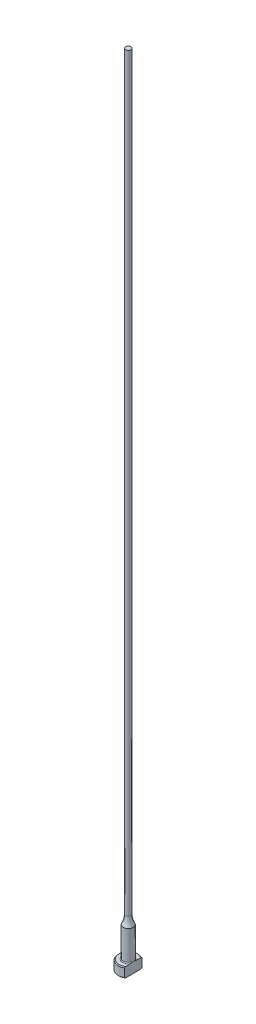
ISO-10303-21;
HEADER;
FILE_DESCRIPTION(('STEP AP214'),'2;1');
FILE_NAME('part.step','',(''),(''),'','','');
FILE_SCHEMA(('AUTOMOTIVE_DESIGN { 1 0 10303 214 1 1 1 1 }'));
ENDSEC;
DATA;
#1=APPLICATION_CONTEXT('core data for automotive mechanical design processes');
#2=APPLICATION_PROTOCOL_DEFINITION('international standard','automotive_design',2000,#1);
#3=PRODUCT_CONTEXT('',#1,'mechanical');
#4=PRODUCT('Part','Part','',(#3));
#5=PRODUCT_RELATED_PRODUCT_CATEGORY('part','',(#4));
#6=PRODUCT_DEFINITION_FORMATION('','',#4);
#7=PRODUCT_DEFINITION_CONTEXT('part definition',#1,'design');
#8=PRODUCT_DEFINITION('design','',#6,#7);
#9=PRODUCT_DEFINITION_SHAPE('','',#8);
#10=(LENGTH_UNIT() NAMED_UNIT(*) SI_UNIT(.MILLI.,.METRE.));
#11=(NAMED_UNIT(*) PLANE_ANGLE_UNIT() SI_UNIT($,.RADIAN.));
#12=(NAMED_UNIT(*) SI_UNIT($,.STERADIAN.) SOLID_ANGLE_UNIT());
#13=UNCERTAINTY_MEASURE_WITH_UNIT(LENGTH_MEASURE(1.E-05),#10,'distance_accuracy_value','');
#14=(GEOMETRIC_REPRESENTATION_CONTEXT(3) GLOBAL_UNCERTAINTY_ASSIGNED_CONTEXT((#13)) GLOBAL_UNIT_ASSIGNED_CONTEXT((#10,
#11,#12)) REPRESENTATION_CONTEXT('',''));
#15=CARTESIAN_POINT('',(0.,0.,0.));
#16=DIRECTION('',(0.,0.,1.));
#17=DIRECTION('',(1.,0.,0.));
#18=AXIS2_PLACEMENT_3D('',#15,#16,#17);
#19=CARTESIAN_POINT('',(-3.17499999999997,3.175,0.));
#20=DIRECTION('',(0.,1.,0.));
#21=DIRECTION('',(0.,0.,1.));
#22=AXIS2_PLACEMENT_3D('',#19,#20,#21);
#23=PLANE('',#22);
#24=CARTESIAN_POINT('',(0.,3.175,0.));
#25=DIRECTION('',(0.,1.,0.));
#26=DIRECTION('',(0.,0.,1.));
#27=AXIS2_PLACEMENT_3D('',#24,#25,#26);
#28=CIRCLE('',#27,2.92099999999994);
#29=CARTESIAN_POINT('',(1.58749999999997,3.175,-2.45195529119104));
#30=VERTEX_POINT('',#29);
#31=CARTESIAN_POINT('',(1.58749999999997,3.175,2.45195529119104));
#32=VERTEX_POINT('',#31);
#33=EDGE_CURVE('E105',#30,#32,#28,.T.);
#34=ORIENTED_EDGE('',*,*,#33,.T.);
#35=DIRECTION('',(0.,0.,1.));
#36=VECTOR('',#35,1.);
#37=CARTESIAN_POINT('',(1.58749999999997,3.17499999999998,2.74963065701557));
#38=LINE('',#37,#36);
#39=CARTESIAN_POINT('',(1.58749999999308,3.175,0.933255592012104));
#40=VERTEX_POINT('',#39);
#41=EDGE_CURVE('E126',#40,#32,#38,.T.);
#42=ORIENTED_EDGE('',*,*,#41,.F.);
#43=CARTESIAN_POINT('',(0.,3.175,0.));
#44=DIRECTION('',(0.,1.,0.));
#45=DIRECTION('',(0.,0.,1.));
#46=AXIS2_PLACEMENT_3D('',#43,#44,#45);
#47=CIRCLE('',#46,1.84149999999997);
#48=CARTESIAN_POINT('',(1.58749999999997,3.17500000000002,-0.933255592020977));
#49=VERTEX_POINT('',#48);
#50=EDGE_CURVE('E11',#40,#49,#47,.F.);
#51=ORIENTED_EDGE('',*,*,#50,.T.);
#52=EDGE_CURVE('E52',#30,#49,#38,.T.);
#53=ORIENTED_EDGE('',*,*,#52,.F.);
#54=EDGE_LOOP('',(#34,#42,#51,#53));
#55=FACE_BOUND('',#54,.T.);
#56=ADVANCED_FACE('F32',(#55),#23,.T.);
#57=CARTESIAN_POINT('',(0.,259.958771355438,0.));
#58=DIRECTION('',(0.,1.,0.));
#59=DIRECTION('',(0.,0.,1.));
#60=AXIS2_PLACEMENT_3D('',#57,#58,#59);
#61=CYLINDRICAL_SURFACE('',#60,3.17499999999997);
#62=CARTESIAN_POINT('',(0.,2.92100000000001,0.));
#63=DIRECTION('',(0.,1.,0.));
#64=DIRECTION('',(0.,0.,1.));
#65=AXIS2_PLACEMENT_3D('',#62,#63,#64);
#66=CIRCLE('',#65,3.17499999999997);
#67=CARTESIAN_POINT('',(1.58749999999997,2.92100000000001,2.74963065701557));
#68=VERTEX_POINT('',#67);
#69=CARTESIAN_POINT('',(1.58749999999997,2.92100000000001,-2.74963065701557));
#70=VERTEX_POINT('',#69);
#71=EDGE_CURVE('E98',#68,#70,#66,.F.);
#72=ORIENTED_EDGE('',*,*,#71,.T.);
#73=DIRECTION('',(0.,-1.,0.));
#74=VECTOR('',#73,1.);
#75=CARTESIAN_POINT('',(1.58749999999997,254.001,-2.74963065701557));
#76=LINE('',#75,#74);
#77=CARTESIAN_POINT('',(1.58749999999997,0.253999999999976,-2.74963065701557));
#78=VERTEX_POINT('',#77);
#79=EDGE_CURVE('E141',#70,#78,#76,.T.);
#80=ORIENTED_EDGE('',*,*,#79,.T.);
#81=CARTESIAN_POINT('',(0.,0.253999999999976,0.));
#82=DIRECTION('',(0.,-1.,0.));
#83=DIRECTION('',(0.,0.,-1.));
#84=AXIS2_PLACEMENT_3D('',#81,#82,#83);
#85=CIRCLE('',#84,3.17499999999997);
#86=CARTESIAN_POINT('',(1.58749999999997,0.253999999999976,2.74963065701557));
#87=VERTEX_POINT('',#86);
#88=EDGE_CURVE('E95',#78,#87,#85,.F.);
#89=ORIENTED_EDGE('',*,*,#88,.T.);
#90=DIRECTION('',(0.,-1.,0.));
#91=VECTOR('',#90,1.);
#92=CARTESIAN_POINT('',(1.58749999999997,254.001,2.74963065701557));
#93=LINE('',#92,#91);
#94=EDGE_CURVE('E88',#68,#87,#93,.T.);
#95=ORIENTED_EDGE('',*,*,#94,.F.);
#96=EDGE_LOOP('',(#72,#80,#89,#95));
#97=FACE_BOUND('',#96,.T.);
#98=ADVANCED_FACE('F191',(#97),#61,.T.);
#99=CARTESIAN_POINT('',(0.,0.,0.));
#100=DIRECTION('',(0.,-1.,0.));
#101=DIRECTION('',(0.,0.,-1.));
#102=AXIS2_PLACEMENT_3D('',#99,#100,#101);
#103=PLANE('',#102);
#104=CARTESIAN_POINT('',(0.,0.,0.));
#105=DIRECTION('',(0.,-1.,0.));
#106=DIRECTION('',(0.,0.,-1.));
#107=AXIS2_PLACEMENT_3D('',#104,#105,#106);
#108=CIRCLE('',#107,2.92100000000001);
#109=CARTESIAN_POINT('',(1.58749999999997,0.,2.45195529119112));
#110=VERTEX_POINT('',#109);
#111=CARTESIAN_POINT('',(1.58749999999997,0.,-2.45195529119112));
#112=VERTEX_POINT('',#111);
#113=EDGE_CURVE('E93',#110,#112,#108,.T.);
#114=ORIENTED_EDGE('',*,*,#113,.T.);
#115=DIRECTION('',(0.,0.,1.));
#116=VECTOR('',#115,1.);
#117=CARTESIAN_POINT('',(1.58749999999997,0.,2.74963065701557));
#118=LINE('',#117,#116);
#119=EDGE_CURVE('E78',#112,#110,#118,.T.);
#120=ORIENTED_EDGE('',*,*,#119,.T.);
#121=EDGE_LOOP('',(#114,#120));
#122=FACE_BOUND('',#121,.T.);
#123=ADVANCED_FACE('F97',(#122),#103,.T.);
#124=CARTESIAN_POINT('',(0.,3.17499999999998,0.));
#125=DIRECTION('',(0.,-1.,0.));
#126=DIRECTION('',(0.,0.,-1.));
#127=AXIS2_PLACEMENT_3D('',#124,#125,#126);
#128=CONICAL_SURFACE('',#127,2.92099999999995,0.785398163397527);
#129=ORIENTED_EDGE('',*,*,#71,.F.);
#130=CARTESIAN_POINT('',(1.58749999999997,-0.16162066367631,-6.0529050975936));
#131=CARTESIAN_POINT('',(1.58749999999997,-0.0288893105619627,-5.91567682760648));
#132=CARTESIAN_POINT('',(1.58749999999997,0.103699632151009,-5.7783103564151));
#133=CARTESIAN_POINT('',(1.58749999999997,0.368508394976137,-5.50321874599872));
#134=CARTESIAN_POINT('',(1.58749999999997,0.500728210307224,-5.36549360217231));
#135=CARTESIAN_POINT('',(1.58749999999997,0.764778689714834,-5.08953516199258));
#136=CARTESIAN_POINT('',(1.58749999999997,0.896609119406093,-4.9513016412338));
#137=CARTESIAN_POINT('',(1.58749999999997,1.15968706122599,-4.67428233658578));
#138=CARTESIAN_POINT('',(1.58749999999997,1.29093457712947,-4.53549655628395));
#139=CARTESIAN_POINT('',(1.58749999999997,1.55007705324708,-4.25997724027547));
#140=CARTESIAN_POINT('',(1.58749999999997,1.67798684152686,-4.12325766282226));
#141=CARTESIAN_POINT('',(1.58749999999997,1.9328486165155,-3.84892898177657));
#142=CARTESIAN_POINT('',(1.58749999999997,2.05980060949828,-3.71131988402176));
#143=CARTESIAN_POINT('',(1.58749999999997,2.31237508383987,-3.43493978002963));
#144=CARTESIAN_POINT('',(1.58749999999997,2.43799784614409,-3.29616903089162));
#145=CARTESIAN_POINT('',(1.58749999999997,2.68741369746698,-3.01699558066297));
#146=CARTESIAN_POINT('',(1.58749999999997,2.81120686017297,-2.8765929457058));
#147=CARTESIAN_POINT('',(1.58749999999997,3.00875865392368,-2.64816703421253));
#148=CARTESIAN_POINT('',(1.58749999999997,3.08336151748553,-2.56087478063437));
#149=CARTESIAN_POINT('',(1.58749999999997,3.2312387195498,-2.38515423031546));
#150=CARTESIAN_POINT('',(1.58749999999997,3.30451292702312,-2.29672582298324));
#151=CARTESIAN_POINT('',(1.58749999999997,3.45004422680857,-2.1174740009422));
#152=CARTESIAN_POINT('',(1.58749999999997,3.5222823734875,-2.02663514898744));
#153=CARTESIAN_POINT('',(1.58749999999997,3.66423097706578,-1.8430252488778));
#154=CARTESIAN_POINT('',(1.58749999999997,3.73394203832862,-1.75025467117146));
#155=CARTESIAN_POINT('',(1.58749999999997,3.87080633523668,-1.5606747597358));
#156=CARTESIAN_POINT('',(1.58749999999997,3.93790459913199,-1.46382547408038));
#157=CARTESIAN_POINT('',(1.58749999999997,4.06669147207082,-1.26632594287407));
#158=CARTESIAN_POINT('',(1.58749999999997,4.1283726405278,-1.16567073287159));
#159=CARTESIAN_POINT('',(1.58749999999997,4.21402252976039,-1.01165766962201));
#160=CARTESIAN_POINT('',(1.58749999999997,4.24127929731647,-0.960142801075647));
#161=CARTESIAN_POINT('',(1.58749999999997,4.2930979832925,-0.855780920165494));
#162=CARTESIAN_POINT('',(1.58749999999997,4.31765941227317,-0.802933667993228));
#163=CARTESIAN_POINT('',(1.58749999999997,4.38614656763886,-0.642461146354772));
#164=CARTESIAN_POINT('',(1.58749999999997,4.42510149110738,-0.532518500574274));
#165=CARTESIAN_POINT('',(1.58749999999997,4.46726244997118,-0.367680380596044));
#166=CARTESIAN_POINT('',(1.58749999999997,4.47844427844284,-0.314802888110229));
#167=CARTESIAN_POINT('',(1.58749999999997,4.49576654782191,-0.208209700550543));
#168=CARTESIAN_POINT('',(1.58749999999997,4.50190743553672,-0.154494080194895));
#169=CARTESIAN_POINT('',(1.58749999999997,4.50871296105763,-0.0468792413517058));
#170=CARTESIAN_POINT('',(1.58749999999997,4.5093945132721,0.00701889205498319));
#171=CARTESIAN_POINT('',(1.58749999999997,4.50527679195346,0.114606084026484));
#172=CARTESIAN_POINT('',(1.58749999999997,4.50047706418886,0.168295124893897));
#173=CARTESIAN_POINT('',(1.58749999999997,4.48579689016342,0.27448544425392));
#174=CARTESIAN_POINT('',(1.58749999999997,4.47596081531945,0.32699298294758));
#175=CARTESIAN_POINT('',(1.58749999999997,4.45181809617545,0.430974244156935));
#176=CARTESIAN_POINT('',(1.58749999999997,4.4375096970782,0.482447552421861));
#177=CARTESIAN_POINT('',(1.58749999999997,4.40502489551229,0.584460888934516));
#178=CARTESIAN_POINT('',(1.58749999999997,4.386827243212,0.634994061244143));
#179=CARTESIAN_POINT('',(1.58749999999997,4.34729308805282,0.734789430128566));
#180=CARTESIAN_POINT('',(1.58749999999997,4.3259572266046,0.784051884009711));
#181=CARTESIAN_POINT('',(1.58749999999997,4.25791922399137,0.930549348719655));
#182=CARTESIAN_POINT('',(1.58749999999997,4.20736047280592,1.0259880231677));
#183=CARTESIAN_POINT('',(1.58749999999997,4.0995545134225,1.21304313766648));
#184=CARTESIAN_POINT('',(1.58749999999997,4.04229912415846,1.30465471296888));
#185=CARTESIAN_POINT('',(1.58749999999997,3.92308746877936,1.48526211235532));
#186=CARTESIAN_POINT('',(1.58749999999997,3.86111349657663,1.57424615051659));
#187=CARTESIAN_POINT('',(1.58749999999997,3.73408621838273,1.74990003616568));
#188=CARTESIAN_POINT('',(1.58749999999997,3.66903444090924,1.83657099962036));
#189=CARTESIAN_POINT('',(1.58749999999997,3.53583371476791,2.00931764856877));
#190=CARTESIAN_POINT('',(1.58749999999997,3.46765527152,2.09537048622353));
#191=CARTESIAN_POINT('',(1.58749999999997,3.32960643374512,2.26611736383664));
#192=CARTESIAN_POINT('',(1.58749999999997,3.25973586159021,2.35081125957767));
#193=CARTESIAN_POINT('',(1.58749999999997,3.04858139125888,2.60290121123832));
#194=CARTESIAN_POINT('',(1.58749999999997,2.90542388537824,2.76872537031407));
#195=CARTESIAN_POINT('',(1.58749999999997,2.64069522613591,3.06970913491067));
#196=CARTESIAN_POINT('',(1.58749999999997,2.51959458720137,3.20528660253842));
#197=CARTESIAN_POINT('',(1.58749999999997,2.27590400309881,3.47510321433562));
#198=CARTESIAN_POINT('',(1.58749999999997,2.15331401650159,3.60934232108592));
#199=CARTESIAN_POINT('',(1.58749999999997,1.90694239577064,3.87695374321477));
#200=CARTESIAN_POINT('',(1.58749999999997,1.78315974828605,4.0103251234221));
#201=CARTESIAN_POINT('',(1.58749999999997,1.53478104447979,4.27630880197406));
#202=CARTESIAN_POINT('',(1.58749999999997,1.41018498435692,4.40892109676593));
#203=CARTESIAN_POINT('',(1.58749999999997,1.0457468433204,4.79499418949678));
#204=CARTESIAN_POINT('',(1.58749999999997,0.80507680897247,5.04767313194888));
#205=CARTESIAN_POINT('',(1.58749999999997,0.443121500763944,5.42550911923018));
#206=CARTESIAN_POINT('',(1.58749999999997,0.322378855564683,5.55118772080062));
#207=CARTESIAN_POINT('',(1.58749999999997,0.0805914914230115,5.80225207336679));
#208=CARTESIAN_POINT('',(1.58749999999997,-0.040453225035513,5.92763782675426));
#209=CARTESIAN_POINT('',(1.58749999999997,-0.161620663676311,6.0529050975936));
#210=B_SPLINE_CURVE_WITH_KNOTS('',3,(#130,#131,#132,#133,#134,#135,#136,#137,#138,#139,#140,
#141,#142,#143,#144,#145,#146,#147,#148,#149,#150,#151,#152,#153,#154,#155,#156,#157,#158,#159,
#160,#161,#162,#163,#164,#165,#166,#167,#168,#169,#170,#171,#172,#173,#174,#175,#176,#177,#178,
#179,#180,#181,#182,#183,#184,#185,#186,#187,#188,#189,#190,#191,#192,#193,#194,#195,#196,#197,
#198,#199,#200,#201,#202,#203,#204,#205,#206,#207,#208,#209),.UNSPECIFIED.,.F.,.F.,(4,2,2,2,2,2,
2,2,2,2,2,2,2,2,2,2,2,2,2,2,2,2,2,2,2,2,2,2,2,2,2,2,2,2,2,2,2,2,2,4),(0.,0.572750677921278,
1.14550874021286,1.71856057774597,2.29160869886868,2.85328006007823,3.4149477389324,
3.97649423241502,4.53801804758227,4.88249307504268,5.22700189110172,5.5751532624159,
5.92322081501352,6.27657800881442,6.63041319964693,6.80518126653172,6.9799810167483,
7.3282426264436,7.49018491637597,7.65211285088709,7.81353889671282,7.97497832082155,
8.13501929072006,8.29512313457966,8.45612518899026,8.61709438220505,8.94062993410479,
9.2645649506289,9.58978187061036,9.91483894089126,10.2441741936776,10.5735441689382,
11.2306812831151,11.7760337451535,12.3214014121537,12.8672825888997,13.4131663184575,
14.4600164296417,14.9828595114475,15.5056983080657),.UNSPECIFIED.);
#211=EDGE_CURVE('E118',#32,#68,#210,.T.);
#212=ORIENTED_EDGE('',*,*,#211,.F.);
#213=ORIENTED_EDGE('',*,*,#33,.F.);
#214=EDGE_CURVE('E117',#70,#30,#210,.T.);
#215=ORIENTED_EDGE('',*,*,#214,.F.);
#216=EDGE_LOOP('',(#129,#212,#213,#215));
#217=FACE_BOUND('',#216,.T.);
#218=ADVANCED_FACE('F162',(#217),#128,.T.);
#219=CARTESIAN_POINT('',(0.,0.253999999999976,0.));
#220=DIRECTION('',(0.,1.,0.));
#221=DIRECTION('',(0.,0.,1.));
#222=AXIS2_PLACEMENT_3D('',#219,#220,#221);
#223=CONICAL_SURFACE('',#222,3.17499999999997,0.785398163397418);
#224=ORIENTED_EDGE('',*,*,#88,.F.);
#225=CARTESIAN_POINT('',(1.58749999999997,3.33662066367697,6.0529050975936));
#226=CARTESIAN_POINT('',(1.58749999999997,3.20388931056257,5.91567682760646));
#227=CARTESIAN_POINT('',(1.58749999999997,3.07130036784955,5.77831035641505));
#228=CARTESIAN_POINT('',(1.58749999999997,2.80649160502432,5.50321874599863));
#229=CARTESIAN_POINT('',(1.58749999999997,2.67427178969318,5.3654936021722));
#230=CARTESIAN_POINT('',(1.58749999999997,2.41022131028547,5.08953516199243));
#231=CARTESIAN_POINT('',(1.58749999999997,2.27839088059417,4.95130164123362));
#232=CARTESIAN_POINT('',(1.58749999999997,2.01531293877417,4.67428233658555));
#233=CARTESIAN_POINT('',(1.58749999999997,1.88406542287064,4.5354965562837));
#234=CARTESIAN_POINT('',(1.58749999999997,1.62492294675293,4.25997724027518));
#235=CARTESIAN_POINT('',(1.58749999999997,1.49701315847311,4.12325766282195));
#236=CARTESIAN_POINT('',(1.58749999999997,1.24215138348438,3.84892898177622));
#237=CARTESIAN_POINT('',(1.58749999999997,1.11519939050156,3.71131988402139));
#238=CARTESIAN_POINT('',(1.58749999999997,0.862624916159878,3.43493978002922));
#239=CARTESIAN_POINT('',(1.58749999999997,0.737002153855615,3.29616903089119));
#240=CARTESIAN_POINT('',(1.58749999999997,0.487586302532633,3.01699558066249));
#241=CARTESIAN_POINT('',(1.58749999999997,0.363793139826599,2.8765929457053));
#242=CARTESIAN_POINT('',(1.58749999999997,0.166241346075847,2.64816703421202));
#243=CARTESIAN_POINT('',(1.58749999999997,0.0916384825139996,2.56087478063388));
#244=CARTESIAN_POINT('',(1.58749999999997,-0.0562387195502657,2.385154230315));
#245=CARTESIAN_POINT('',(1.58749999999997,-0.129512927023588,2.29672582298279));
#246=CARTESIAN_POINT('',(1.58749999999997,-0.27504422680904,2.11747400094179));
#247=CARTESIAN_POINT('',(1.58749999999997,-0.347282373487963,2.02663514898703));
#248=CARTESIAN_POINT('',(1.58749999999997,-0.489230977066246,1.84302524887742));
#249=CARTESIAN_POINT('',(1.58749999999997,-0.558942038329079,1.7502546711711));
#250=CARTESIAN_POINT('',(1.58749999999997,-0.695806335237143,1.56067475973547));
#251=CARTESIAN_POINT('',(1.58749999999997,-0.762904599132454,1.46382547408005));
#252=CARTESIAN_POINT('',(1.58749999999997,-0.891691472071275,1.26632594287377));
#253=CARTESIAN_POINT('',(1.58749999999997,-0.953372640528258,1.16567073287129));
#254=CARTESIAN_POINT('',(1.58749999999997,-1.03902252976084,1.01165766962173));
#255=CARTESIAN_POINT('',(1.58749999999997,-1.06627929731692,0.960142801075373));
#256=CARTESIAN_POINT('',(1.58749999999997,-1.11809798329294,0.85578092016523));
#257=CARTESIAN_POINT('',(1.58749999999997,-1.14265941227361,0.802933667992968));
#258=CARTESIAN_POINT('',(1.58749999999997,-1.21114656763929,0.642461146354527));
#259=CARTESIAN_POINT('',(1.58749999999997,-1.2501014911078,0.532518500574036));
#260=CARTESIAN_POINT('',(1.58749999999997,-1.29226244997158,0.367680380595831));
#261=CARTESIAN_POINT('',(1.58749999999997,-1.30344427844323,0.314802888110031));
#262=CARTESIAN_POINT('',(1.58749999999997,-1.32076654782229,0.208209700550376));
#263=CARTESIAN_POINT('',(1.58749999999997,-1.3269074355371,0.154494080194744));
#264=CARTESIAN_POINT('',(1.58749999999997,-1.333712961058,0.0468792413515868));
#265=CARTESIAN_POINT('',(1.58749999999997,-1.33439451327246,-0.00701889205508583));
#266=CARTESIAN_POINT('',(1.58749999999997,-1.33027679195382,-0.114606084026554));
#267=CARTESIAN_POINT('',(1.58749999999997,-1.32547706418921,-0.168295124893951));
#268=CARTESIAN_POINT('',(1.58749999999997,-1.31079689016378,-0.274485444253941));
#269=CARTESIAN_POINT('',(1.58749999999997,-1.3009608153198,-0.326992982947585));
#270=CARTESIAN_POINT('',(1.58749999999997,-1.27681809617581,-0.430974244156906));
#271=CARTESIAN_POINT('',(1.58749999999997,-1.26250969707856,-0.482447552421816));
#272=CARTESIAN_POINT('',(1.58749999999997,-1.23002489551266,-0.584460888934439));
#273=CARTESIAN_POINT('',(1.58749999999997,-1.21182724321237,-0.634994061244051));
#274=CARTESIAN_POINT('',(1.58749999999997,-1.1722930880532,-0.734789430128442));
#275=CARTESIAN_POINT('',(1.58749999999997,-1.15095722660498,-0.784051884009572));
#276=CARTESIAN_POINT('',(1.58749999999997,-1.08291922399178,-0.93054934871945));
#277=CARTESIAN_POINT('',(1.58749999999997,-1.03236047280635,-1.02598802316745));
#278=CARTESIAN_POINT('',(1.58749999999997,-0.924554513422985,-1.21304313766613));
#279=CARTESIAN_POINT('',(1.58749999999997,-0.86729912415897,-1.30465471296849));
#280=CARTESIAN_POINT('',(1.58749999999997,-0.748087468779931,-1.48526211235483));
#281=CARTESIAN_POINT('',(1.58749999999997,-0.686113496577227,-1.57424615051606));
#282=CARTESIAN_POINT('',(1.58749999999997,-0.55908621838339,-1.74990003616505));
#283=CARTESIAN_POINT('',(1.58749999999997,-0.494034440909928,-1.83657099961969));
#284=CARTESIAN_POINT('',(1.58749999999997,-0.360833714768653,-2.00931764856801));
#285=CARTESIAN_POINT('',(1.58749999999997,-0.292655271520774,-2.09537048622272));
#286=CARTESIAN_POINT('',(1.58749999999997,-0.154606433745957,-2.26611736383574));
#287=CARTESIAN_POINT('',(1.58749999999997,-0.0847358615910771,-2.35081125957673));
#288=CARTESIAN_POINT('',(1.58749999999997,0.126418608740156,-2.60290121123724));
#289=CARTESIAN_POINT('',(1.58749999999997,0.269576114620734,-2.76872537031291));
#290=CARTESIAN_POINT('',(1.58749999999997,0.534304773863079,-3.06970913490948));
#291=CARTESIAN_POINT('',(1.58749999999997,0.655405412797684,-3.20528660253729));
#292=CARTESIAN_POINT('',(1.58749999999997,0.899095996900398,-3.47510321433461));
#293=CARTESIAN_POINT('',(1.58749999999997,1.02168598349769,-3.60934232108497));
#294=CARTESIAN_POINT('',(1.58749999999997,1.26805760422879,-3.87695374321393));
#295=CARTESIAN_POINT('',(1.58749999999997,1.39184025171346,-4.01032512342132));
#296=CARTESIAN_POINT('',(1.58749999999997,1.64021895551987,-4.2763088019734));
#297=CARTESIAN_POINT('',(1.58749999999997,1.76481501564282,-4.40892109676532));
#298=CARTESIAN_POINT('',(1.58749999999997,2.12925315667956,-4.79499418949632));
#299=CARTESIAN_POINT('',(1.58749999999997,2.36992319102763,-5.04767313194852));
#300=CARTESIAN_POINT('',(1.58749999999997,2.73187849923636,-5.42550911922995));
#301=CARTESIAN_POINT('',(1.58749999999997,2.85262114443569,-5.55118772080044));
#302=CARTESIAN_POINT('',(1.58749999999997,3.09440850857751,-5.8022520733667));
#303=CARTESIAN_POINT('',(1.58749999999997,3.2154532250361,-5.92763782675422));
#304=CARTESIAN_POINT('',(1.58749999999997,3.33662066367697,-6.0529050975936));
#305=B_SPLINE_CURVE_WITH_KNOTS('',3,(#225,#226,#227,#228,#229,#230,#231,#232,#233,#234,#235,
#236,#237,#238,#239,#240,#241,#242,#243,#244,#245,#246,#247,#248,#249,#250,#251,#252,#253,#254,
#255,#256,#257,#258,#259,#260,#261,#262,#263,#264,#265,#266,#267,#268,#269,#270,#271,#272,#273,
#274,#275,#276,#277,#278,#279,#280,#281,#282,#283,#284,#285,#286,#287,#288,#289,#290,#291,#292,
#293,#294,#295,#296,#297,#298,#299,#300,#301,#302,#303,#304),.UNSPECIFIED.,.F.,.F.,(4,2,2,2,2,2,
2,2,2,2,2,2,2,2,2,2,2,2,2,2,2,2,2,2,2,2,2,2,2,2,2,2,2,2,2,2,2,2,2,4),(0.,0.57275067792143,
1.14550874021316,1.71856057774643,2.29160869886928,2.85328006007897,3.41494773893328,
3.97649423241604,4.53801804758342,4.88249307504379,5.2270018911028,5.57515326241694,
5.92322081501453,6.27657800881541,6.63041319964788,6.80518126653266,6.97998101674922,
7.32824262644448,7.49018491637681,7.65211285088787,7.81353889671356,7.97497832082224,
8.1350192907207,8.29512313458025,8.45612518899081,8.61709438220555,8.94062993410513,
9.26456495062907,9.58978187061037,9.91483894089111,10.2441741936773,10.5735441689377,
11.2306812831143,11.776033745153,12.3214014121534,12.8672825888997,13.4131663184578,
14.4600164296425,14.9828595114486,15.505698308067),.UNSPECIFIED.);
#306=EDGE_CURVE('E81',#112,#78,#305,.T.);
#307=ORIENTED_EDGE('',*,*,#306,.F.);
#308=ORIENTED_EDGE('',*,*,#113,.F.);
#309=EDGE_CURVE('E84',#87,#110,#305,.T.);
#310=ORIENTED_EDGE('',*,*,#309,.F.);
#311=EDGE_LOOP('',(#224,#307,#308,#310));
#312=FACE_BOUND('',#311,.T.);
#313=ADVANCED_FACE('F92',(#312),#223,.T.);
#314=CARTESIAN_POINT('',(0.,3.42900000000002,0.));
#315=DIRECTION('',(0.,1.,0.));
#316=DIRECTION('',(0.,0.,1.));
#317=AXIS2_PLACEMENT_3D('',#314,#315,#316);
#318=TOROIDAL_SURFACE('',#317,1.84149999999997,0.254);
#319=CARTESIAN_POINT('',(1.58749999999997,3.42900000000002,0.));
#320=CARTESIAN_POINT('',(1.58749999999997,3.42899942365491,-1.9220514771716E-10));
#321=CARTESIAN_POINT('',(1.58749999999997,3.42899884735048,-1.2261161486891E-07));
#322=CARTESIAN_POINT('',(1.58749999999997,3.42899773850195,-5.09676365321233E-07));
#323=CARTESIAN_POINT('',(1.58749999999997,3.42899720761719,-7.78176328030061E-07));
#324=CARTESIAN_POINT('',(1.58749999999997,3.42899614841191,-1.42307272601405E-06));
#325=CARTESIAN_POINT('',(1.58749999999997,3.42899562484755,-1.80713867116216E-06));
#326=CARTESIAN_POINT('',(1.58749999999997,3.42899463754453,-2.63494846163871E-06));
#327=CARTESIAN_POINT('',(1.58749999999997,3.42899417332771,-3.07814756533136E-06));
#328=CARTESIAN_POINT('',(1.58749999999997,3.42899261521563,-4.66897357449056E-06));
#329=CARTESIAN_POINT('',(1.58749999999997,3.42899159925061,-5.89404908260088E-06));
#330=CARTESIAN_POINT('',(1.58749999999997,3.42898979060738,-8.42427511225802E-06));
#331=CARTESIAN_POINT('',(1.58749999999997,3.42898899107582,-9.7248057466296E-06));
#332=CARTESIAN_POINT('',(1.58749999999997,3.42898598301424,-1.48060601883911E-05));
#333=CARTESIAN_POINT('',(1.58749999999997,3.42898393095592,-1.86838281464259E-05));
#334=CARTESIAN_POINT('',(1.58749999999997,3.42898057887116,-2.63261117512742E-05));
#335=CARTESIAN_POINT('',(1.58749999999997,3.42897922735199,-3.00687417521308E-05));
#336=CARTESIAN_POINT('',(1.58749999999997,3.42897347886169,-4.60276298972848E-05));
#337=CARTESIAN_POINT('',(1.58749999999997,3.42896911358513,-5.8247019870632E-05));
#338=CARTESIAN_POINT('',(1.58749999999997,3.42896211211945,-8.11070097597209E-05));
#339=CARTESIAN_POINT('',(1.58749999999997,3.42895931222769,-9.16953114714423E-05));
#340=CARTESIAN_POINT('',(1.58749999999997,3.42893712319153,-0.000168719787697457));
#341=CARTESIAN_POINT('',(1.58749999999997,3.42890881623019,-0.000232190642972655));
#342=CARTESIAN_POINT('',(1.58749999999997,3.42880276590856,-0.000479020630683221));
#343=CARTESIAN_POINT('',(1.58749999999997,3.42873165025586,-0.00066443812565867));
#344=CARTESIAN_POINT('',(1.58749999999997,3.42845137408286,-0.0013844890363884));
#345=CARTESIAN_POINT('',(1.58749999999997,3.42823526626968,-0.00191701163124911));
#346=CARTESIAN_POINT('',(1.58749999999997,3.42735449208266,-0.00409774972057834));
#347=CARTESIAN_POINT('',(1.58749999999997,3.42669768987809,-0.00574830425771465));
#348=CARTESIAN_POINT('',(1.58749999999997,3.4174405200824,-0.0289985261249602));
#349=CARTESIAN_POINT('',(1.58749999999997,3.40878325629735,-0.0505816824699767));
#350=CARTESIAN_POINT('',(1.58749999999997,3.39189297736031,-0.0929947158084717));
#351=CARTESIAN_POINT('',(1.58749999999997,3.38365605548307,-0.11382315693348));
#352=CARTESIAN_POINT('',(1.58749999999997,3.36635393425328,-0.157956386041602));
#353=CARTESIAN_POINT('',(1.58749999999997,3.35730391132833,-0.181267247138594));
#354=CARTESIAN_POINT('',(1.58749999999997,3.33936775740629,-0.228222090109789));
#355=CARTESIAN_POINT('',(1.58749999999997,3.33048420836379,-0.25186705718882));
#356=CARTESIAN_POINT('',(1.58749999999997,3.30894496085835,-0.310512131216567));
#357=CARTESIAN_POINT('',(1.58749999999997,3.29649449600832,-0.345588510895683));
#358=CARTESIAN_POINT('',(1.58749999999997,3.27296975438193,-0.415278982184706));
#359=CARTESIAN_POINT('',(1.58749999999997,3.26186987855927,-0.449884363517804));
#360=CARTESIAN_POINT('',(1.58749999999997,3.2395832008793,-0.524471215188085));
#361=CARTESIAN_POINT('',(1.58749999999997,3.22860862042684,-0.564517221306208));
#362=CARTESIAN_POINT('',(1.58749999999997,3.20902534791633,-0.645529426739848));
#363=CARTESIAN_POINT('',(1.58749999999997,3.20043582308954,-0.686500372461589));
#364=CARTESIAN_POINT('',(1.58749999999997,3.18611712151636,-0.771546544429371));
#365=CARTESIAN_POINT('',(1.58749999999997,3.18059550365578,-0.815658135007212));
#366=CARTESIAN_POINT('',(1.58749999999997,3.17455396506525,-0.904117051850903));
#367=CARTESIAN_POINT('',(1.58749999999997,3.17401361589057,-0.948462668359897));
#368=CARTESIAN_POINT('',(1.58749999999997,3.17898948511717,-1.02531896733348));
#369=CARTESIAN_POINT('',(1.58749999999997,3.1829739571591,-1.05792141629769));
#370=CARTESIAN_POINT('',(1.58749999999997,3.19569167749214,-1.12184393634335));
#371=CARTESIAN_POINT('',(1.58749999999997,3.20436049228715,-1.1531753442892));
#372=CARTESIAN_POINT('',(1.58749999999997,3.22236152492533,-1.19946468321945));
#373=CARTESIAN_POINT('',(1.58749999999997,3.2295150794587,-1.21526783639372));
#374=CARTESIAN_POINT('',(1.58749999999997,3.24587062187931,-1.24583726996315));
#375=CARTESIAN_POINT('',(1.58749999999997,3.25507530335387,-1.26060215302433));
#376=CARTESIAN_POINT('',(1.58749999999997,3.27378481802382,-1.28575815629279));
#377=CARTESIAN_POINT('',(1.58749999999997,3.28289001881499,-1.29644383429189));
#378=CARTESIAN_POINT('',(1.58749999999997,3.30268460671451,-1.31623154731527));
#379=CARTESIAN_POINT('',(1.58749999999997,3.31337067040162,-1.32533681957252));
#380=CARTESIAN_POINT('',(1.58749999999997,3.33349977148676,-1.33941140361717));
#381=CARTESIAN_POINT('',(1.58749999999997,3.34261446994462,-1.34484814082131));
#382=CARTESIAN_POINT('',(1.58749999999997,3.36161455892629,-1.35416329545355));
#383=CARTESIAN_POINT('',(1.58749999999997,3.37149946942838,-1.35804267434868));
#384=CARTESIAN_POINT('',(1.58749999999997,3.39188678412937,-1.36398436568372));
#385=CARTESIAN_POINT('',(1.58749999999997,3.40239309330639,-1.36603350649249));
#386=CARTESIAN_POINT('',(1.58749999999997,3.42360372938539,-1.3680840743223));
#387=CARTESIAN_POINT('',(1.58749999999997,3.43430795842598,-1.36808648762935));
#388=CARTESIAN_POINT('',(1.58749999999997,3.45433283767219,-1.36616208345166));
#389=CARTESIAN_POINT('',(1.58749999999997,3.46367506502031,-1.36444960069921));
#390=CARTESIAN_POINT('',(1.58749999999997,3.48195519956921,-1.35953338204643));
#391=CARTESIAN_POINT('',(1.58749999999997,3.49089304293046,-1.3563294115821));
#392=CARTESIAN_POINT('',(1.58749999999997,3.50850302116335,-1.34848006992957));
#393=CARTESIAN_POINT('',(1.58749999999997,3.5171531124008,-1.34378578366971));
#394=CARTESIAN_POINT('',(1.58749999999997,3.53371257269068,-1.33324445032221));
#395=CARTESIAN_POINT('',(1.58749999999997,3.54162163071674,-1.32739692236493));
#396=CARTESIAN_POINT('',(1.58749999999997,3.56107121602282,-1.31107304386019));
#397=CARTESIAN_POINT('',(1.58749999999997,3.57202221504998,-1.29989286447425));
#398=CARTESIAN_POINT('',(1.58749999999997,3.59202509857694,-1.27593566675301));
#399=CARTESIAN_POINT('',(1.58749999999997,3.60107086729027,-1.26315370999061));
#400=CARTESIAN_POINT('',(1.58749999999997,3.62186023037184,-1.22930733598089));
#401=CARTESIAN_POINT('',(1.58749999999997,3.63240584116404,-1.20751096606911));
#402=CARTESIAN_POINT('',(1.58749999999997,3.65004643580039,-1.16266144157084));
#403=CARTESIAN_POINT('',(1.58749999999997,3.65714435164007,-1.13960937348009));
#404=CARTESIAN_POINT('',(1.58749999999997,3.67265428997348,-1.07603916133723));
#405=CARTESIAN_POINT('',(1.58749999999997,3.67834921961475,-1.03486686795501));
#406=CARTESIAN_POINT('',(1.58749999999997,3.68382880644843,-0.951558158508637));
#407=CARTESIAN_POINT('',(1.58749999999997,3.68350976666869,-0.909417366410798));
#408=CARTESIAN_POINT('',(1.58749999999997,3.67745397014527,-0.811383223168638));
#409=CARTESIAN_POINT('',(1.58749999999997,3.66993873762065,-0.755610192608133));
#410=CARTESIAN_POINT('',(1.58749999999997,3.64933373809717,-0.644937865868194));
#411=CARTESIAN_POINT('',(1.58749999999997,3.63621897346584,-0.59004364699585));
#412=CARTESIAN_POINT('',(1.58749999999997,3.60740922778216,-0.485757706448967));
#413=CARTESIAN_POINT('',(1.58749999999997,3.59201096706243,-0.436281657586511));
#414=CARTESIAN_POINT('',(1.58749999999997,3.55922497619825,-0.338551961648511));
#415=CARTESIAN_POINT('',(1.58749999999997,3.5418584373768,-0.290291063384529));
#416=CARTESIAN_POINT('',(1.58749999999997,3.51760237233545,-0.225557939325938));
#417=CARTESIAN_POINT('',(1.58749999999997,3.51126413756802,-0.208874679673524));
#418=CARTESIAN_POINT('',(1.58749999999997,3.49830042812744,-0.17512392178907));
#419=CARTESIAN_POINT('',(1.58749999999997,3.49167176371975,-0.158057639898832));
#420=CARTESIAN_POINT('',(1.58749999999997,3.47585523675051,-0.117638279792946));
#421=CARTESIAN_POINT('',(1.58749999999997,3.46662970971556,-0.0943002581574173));
#422=CARTESIAN_POINT('',(1.58749999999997,3.44889695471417,-0.0497824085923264));
#423=CARTESIAN_POINT('',(1.58749999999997,3.44040039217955,-0.028598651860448));
#424=CARTESIAN_POINT('',(1.58749999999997,3.43130364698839,-0.00575168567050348));
#425=CARTESIAN_POINT('',(1.58749999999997,3.43064818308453,-0.00410451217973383));
#426=CARTESIAN_POINT('',(1.58749999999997,3.42976776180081,-0.00192459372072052));
#427=CARTESIAN_POINT('',(1.58749999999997,3.42955062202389,-0.00138952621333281));
#428=CARTESIAN_POINT('',(1.58749999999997,3.42926908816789,-0.000666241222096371));
#429=CARTESIAN_POINT('',(1.58749999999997,3.42919771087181,-0.000480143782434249));
#430=CARTESIAN_POINT('',(1.58749999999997,3.42909131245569,-0.000232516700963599));
#431=CARTESIAN_POINT('',(1.58749999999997,3.42906294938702,-0.000168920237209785));
#432=CARTESIAN_POINT('',(1.58749999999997,3.42904072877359,-9.17527162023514E-05));
#433=CARTESIAN_POINT('',(1.58749999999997,3.42903792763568,-8.11550293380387E-05));
#434=CARTESIAN_POINT('',(1.58749999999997,3.42903091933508,-5.82743948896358E-05));
#435=CARTESIAN_POINT('',(1.58749999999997,3.42902654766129,-4.60440001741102E-05));
#436=CARTESIAN_POINT('',(1.58749999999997,3.42902079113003,-3.00727682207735E-05));
#437=CARTESIAN_POINT('',(1.58749999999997,3.42901943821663,-2.63286807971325E-05));
#438=CARTESIAN_POINT('',(1.58749999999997,3.42901608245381,-1.86836529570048E-05));
#439=CARTESIAN_POINT('',(1.58749999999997,3.4290140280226,-1.48046517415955E-05));
#440=CARTESIAN_POINT('',(1.58749999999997,3.42901101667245,-9.72223943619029E-06));
#441=CARTESIAN_POINT('',(1.58749999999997,3.42901021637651,-8.42159649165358E-06));
#442=CARTESIAN_POINT('',(1.58749999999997,3.42900840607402,-5.89129729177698E-06));
#443=CARTESIAN_POINT('',(1.58749999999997,3.42900738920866,-4.66626867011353E-06));
#444=CARTESIAN_POINT('',(1.58749999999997,3.42900582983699,-3.07568803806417E-06));
#445=CARTESIAN_POINT('',(1.58749999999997,3.42900536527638,-2.63259565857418E-06));
#446=CARTESIAN_POINT('',(1.58749999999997,3.4290043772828,-1.80506085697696E-06));
#447=CARTESIAN_POINT('',(1.58749999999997,3.42900385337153,-1.42116387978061E-06));
#448=CARTESIAN_POINT('',(1.58749999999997,3.42900279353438,-7.76675643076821E-07));
#449=CARTESIAN_POINT('',(1.58749999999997,3.42900226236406,-5.08406487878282E-07));
#450=CARTESIAN_POINT('',(1.58749999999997,3.42900115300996,-1.21901887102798E-07));
#451=CARTESIAN_POINT('',(1.58749999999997,3.42900057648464,1.92251677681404E-10));
#452=CARTESIAN_POINT('',(1.58749999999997,3.42900000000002,0.));
#453=B_SPLINE_CURVE_WITH_KNOTS('',3,(#319,#320,#321,#322,#323,#324,#325,#326,#327,#328,#329,
#330,#331,#332,#333,#334,#335,#336,#337,#338,#339,#340,#341,#342,#343,#344,#345,#346,#347,#348,
#349,#350,#351,#352,#353,#354,#355,#356,#357,#358,#359,#360,#361,#362,#363,#364,#365,#366,#367,
#368,#369,#370,#371,#372,#373,#374,#375,#376,#377,#378,#379,#380,#381,#382,#383,#384,#385,#386,
#387,#388,#389,#390,#391,#392,#393,#394,#395,#396,#397,#398,#399,#400,#401,#402,#403,#404,#405,
#406,#407,#408,#409,#410,#411,#412,#413,#414,#415,#416,#417,#418,#419,#420,#421,#422,#423,#424,
#425,#426,#427,#428,#429,#430,#431,#432,#433,#434,#435,#436,#437,#438,#439,#440,#441,#442,#443,
#444,#445,#446,#447,#448,#449,#450,#451,#452),.UNSPECIFIED.,.T.,.F.,(4,2,2,2,2,2,2,2,2,2,2,2,2,
2,2,2,2,2,2,2,2,2,2,2,2,2,2,2,2,2,2,2,2,2,2,2,2,2,2,2,2,2,2,2,2,2,2,2,2,2,2,2,2,2,2,2,2,2,2,2,2,
2,2,2,2,2,4),(0.,1.72815458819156E-06,3.50429255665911E-06,5.44431004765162E-06,
7.3675525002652E-06,1.2119089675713E-05,1.66953775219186E-05,2.98160400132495E-05,
4.17409564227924E-05,8.0660475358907E-05,0.000113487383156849,0.000321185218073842,
0.000917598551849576,0.00264089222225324,0.00797105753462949,0.0777276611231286,
0.144923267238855,0.219939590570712,0.295714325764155,0.407362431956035,0.516367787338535,
0.640878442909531,0.766362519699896,0.899536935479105,1.03216495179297,1.13045740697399,
1.22743103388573,1.27935899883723,1.33135556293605,1.37333248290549,1.41522237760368,
1.44693946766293,1.47863694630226,1.51056074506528,1.54246916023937,1.57083210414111,
1.59919951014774,1.62861579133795,1.65804436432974,1.70472658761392,1.75155645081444,
1.82378709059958,1.89595619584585,2.01995471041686,2.1460932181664,2.31447224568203,
2.48361094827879,2.6389891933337,2.79283011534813,2.84637031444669,2.9012946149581,
2.97658236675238,3.04504771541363,3.05036697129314,3.05209849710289,3.05269709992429,
3.05290520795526,3.05293806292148,3.05297701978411,3.05298895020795,3.05300207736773,
3.05300665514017,3.0530114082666,3.05301333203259,3.05301527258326,3.05301704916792,
3.05301877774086),.UNSPECIFIED.);
#454=CARTESIAN_POINT('',(1.58749999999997,3.42900000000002,0.));
#455=VERTEX_POINT('',#454);
#456=EDGE_CURVE('E47',#455,#49,#453,.T.);
#457=ORIENTED_EDGE('',*,*,#456,.T.);
#458=ORIENTED_EDGE('',*,*,#50,.F.);
#459=CARTESIAN_POINT('',(1.58749999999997,3.42900000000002,0.));
#460=CARTESIAN_POINT('',(1.58749999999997,3.42900057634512,1.9220512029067E-10));
#461=CARTESIAN_POINT('',(1.58749999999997,3.42900115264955,1.22611614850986E-07));
#462=CARTESIAN_POINT('',(1.58749999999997,3.42900226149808,5.09676365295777E-07));
#463=CARTESIAN_POINT('',(1.58749999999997,3.42900279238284,7.78176328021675E-07));
#464=CARTESIAN_POINT('',(1.58749999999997,3.42900385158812,1.42307272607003E-06));
#465=CARTESIAN_POINT('',(1.58749999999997,3.42900437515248,1.80713867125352E-06));
#466=CARTESIAN_POINT('',(1.58749999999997,3.4290053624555,2.63494846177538E-06));
#467=CARTESIAN_POINT('',(1.58749999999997,3.42900582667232,3.0781475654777E-06));
#468=CARTESIAN_POINT('',(1.58749999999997,3.4290073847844,4.66897357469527E-06));
#469=CARTESIAN_POINT('',(1.58749999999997,3.42900840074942,5.89404908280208E-06));
#470=CARTESIAN_POINT('',(1.58749999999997,3.42901020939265,8.42427511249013E-06));
#471=CARTESIAN_POINT('',(1.58749999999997,3.42901100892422,9.72480574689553E-06));
#472=CARTESIAN_POINT('',(1.58749999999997,3.42901401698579,1.48060601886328E-05));
#473=CARTESIAN_POINT('',(1.58749999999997,3.42901606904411,1.86838281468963E-05));
#474=CARTESIAN_POINT('',(1.58749999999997,3.42901942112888,2.63261117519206E-05));
#475=CARTESIAN_POINT('',(1.58749999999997,3.42902077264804,3.00687417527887E-05));
#476=CARTESIAN_POINT('',(1.58749999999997,3.42902652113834,4.60276298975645E-05));
#477=CARTESIAN_POINT('',(1.58749999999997,3.4290308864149,5.82470198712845E-05));
#478=CARTESIAN_POINT('',(1.58749999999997,3.42903788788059,8.11070097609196E-05));
#479=CARTESIAN_POINT('',(1.58749999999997,3.42904068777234,9.16953114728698E-05));
#480=CARTESIAN_POINT('',(1.58749999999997,3.4290628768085,0.000168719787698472));
#481=CARTESIAN_POINT('',(1.58749999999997,3.42909118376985,0.000232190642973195));
#482=CARTESIAN_POINT('',(1.58749999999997,3.42919723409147,0.000479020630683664));
#483=CARTESIAN_POINT('',(1.58749999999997,3.42926834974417,0.000664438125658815));
#484=CARTESIAN_POINT('',(1.58749999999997,3.42954862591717,0.00138448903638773));
#485=CARTESIAN_POINT('',(1.58749999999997,3.42976473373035,0.00191701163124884));
#486=CARTESIAN_POINT('',(1.58749999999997,3.43064550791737,0.00409774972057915));
#487=CARTESIAN_POINT('',(1.58749999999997,3.43130231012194,0.00574830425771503));
#488=CARTESIAN_POINT('',(1.58749999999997,3.44055947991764,0.0289985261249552));
#489=CARTESIAN_POINT('',(1.58749999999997,3.44921674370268,0.0505816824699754));
#490=CARTESIAN_POINT('',(1.58749999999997,3.46610702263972,0.0929947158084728));
#491=CARTESIAN_POINT('',(1.58749999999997,3.47434394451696,0.11382315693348));
#492=CARTESIAN_POINT('',(1.58749999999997,3.49164606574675,0.157956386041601));
#493=CARTESIAN_POINT('',(1.58749999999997,3.5006960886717,0.181267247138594));
#494=CARTESIAN_POINT('',(1.58749999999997,3.51863224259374,0.228222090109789));
#495=CARTESIAN_POINT('',(1.58749999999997,3.52751579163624,0.25186705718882));
#496=CARTESIAN_POINT('',(1.58749999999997,3.54905503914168,0.310512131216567));
#497=CARTESIAN_POINT('',(1.58749999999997,3.56150550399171,0.345588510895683));
#498=CARTESIAN_POINT('',(1.58749999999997,3.5850302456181,0.415278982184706));
#499=CARTESIAN_POINT('',(1.58749999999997,3.59613012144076,0.449884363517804));
#500=CARTESIAN_POINT('',(1.58749999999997,3.61841679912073,0.524471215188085));
#501=CARTESIAN_POINT('',(1.58749999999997,3.62939137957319,0.564517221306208));
#502=CARTESIAN_POINT('',(1.58749999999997,3.6489746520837,0.645529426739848));
#503=CARTESIAN_POINT('',(1.58749999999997,3.65756417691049,0.686500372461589));
#504=CARTESIAN_POINT('',(1.58749999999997,3.67188287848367,0.771546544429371));
#505=CARTESIAN_POINT('',(1.58749999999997,3.67740449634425,0.815658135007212));
#506=CARTESIAN_POINT('',(1.58749999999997,3.68344603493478,0.904117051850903));
#507=CARTESIAN_POINT('',(1.58749999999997,3.68398638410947,0.948462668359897));
#508=CARTESIAN_POINT('',(1.58749999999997,3.67901051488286,1.02531896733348));
#509=CARTESIAN_POINT('',(1.58749999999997,3.67502604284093,1.05792141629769));
#510=CARTESIAN_POINT('',(1.58749999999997,3.66230832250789,1.12184393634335));
#511=CARTESIAN_POINT('',(1.58749999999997,3.65363950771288,1.1531753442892));
#512=CARTESIAN_POINT('',(1.58749999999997,3.6356384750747,1.19946468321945));
#513=CARTESIAN_POINT('',(1.58749999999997,3.62848492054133,1.21526783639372));
#514=CARTESIAN_POINT('',(1.58749999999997,3.61212937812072,1.24583726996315));
#515=CARTESIAN_POINT('',(1.58749999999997,3.60292469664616,1.26060215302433));
#516=CARTESIAN_POINT('',(1.58749999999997,3.58421518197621,1.28575815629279));
#517=CARTESIAN_POINT('',(1.58749999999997,3.57510998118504,1.29644383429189));
#518=CARTESIAN_POINT('',(1.58749999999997,3.55531539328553,1.31623154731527));
#519=CARTESIAN_POINT('',(1.58749999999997,3.54462932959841,1.32533681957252));
#520=CARTESIAN_POINT('',(1.58749999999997,3.52450022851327,1.33941140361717));
#521=CARTESIAN_POINT('',(1.58749999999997,3.51538553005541,1.34484814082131));
#522=CARTESIAN_POINT('',(1.58749999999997,3.49638544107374,1.35416329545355));
#523=CARTESIAN_POINT('',(1.58749999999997,3.48650053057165,1.35804267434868));
#524=CARTESIAN_POINT('',(1.58749999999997,3.46611321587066,1.36398436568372));
#525=CARTESIAN_POINT('',(1.58749999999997,3.45560690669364,1.36603350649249));
#526=CARTESIAN_POINT('',(1.58749999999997,3.43439627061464,1.3680840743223));
#527=CARTESIAN_POINT('',(1.58749999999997,3.42369204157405,1.36808648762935));
#528=CARTESIAN_POINT('',(1.58749999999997,3.40366716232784,1.36616208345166));
#529=CARTESIAN_POINT('',(1.58749999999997,3.39432493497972,1.36444960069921));
#530=CARTESIAN_POINT('',(1.58749999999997,3.37604480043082,1.35953338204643));
#531=CARTESIAN_POINT('',(1.58749999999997,3.36710695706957,1.3563294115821));
#532=CARTESIAN_POINT('',(1.58749999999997,3.34949697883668,1.34848006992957));
#533=CARTESIAN_POINT('',(1.58749999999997,3.34084688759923,1.34378578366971));
#534=CARTESIAN_POINT('',(1.58749999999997,3.32428742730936,1.33324445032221));
#535=CARTESIAN_POINT('',(1.58749999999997,3.31637836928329,1.32739692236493));
#536=CARTESIAN_POINT('',(1.58749999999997,3.29692878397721,1.31107304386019));
#537=CARTESIAN_POINT('',(1.58749999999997,3.28597778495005,1.29989286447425));
#538=CARTESIAN_POINT('',(1.58749999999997,3.26597490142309,1.27593566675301));
#539=CARTESIAN_POINT('',(1.58749999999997,3.25692913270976,1.26315370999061));
#540=CARTESIAN_POINT('',(1.58749999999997,3.23613976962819,1.22930733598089));
#541=CARTESIAN_POINT('',(1.58749999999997,3.22559415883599,1.20751096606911));
#542=CARTESIAN_POINT('',(1.58749999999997,3.20795356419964,1.16266144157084));
#543=CARTESIAN_POINT('',(1.58749999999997,3.20085564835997,1.13960937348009));
#544=CARTESIAN_POINT('',(1.58749999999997,3.18534571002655,1.07603916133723));
#545=CARTESIAN_POINT('',(1.58749999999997,3.17965078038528,1.03486686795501));
#546=CARTESIAN_POINT('',(1.58749999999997,3.1741711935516,0.951558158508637));
#547=CARTESIAN_POINT('',(1.58749999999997,3.17449023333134,0.909417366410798));
#548=CARTESIAN_POINT('',(1.58749999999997,3.18054602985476,0.811383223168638));
#549=CARTESIAN_POINT('',(1.58749999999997,3.18806126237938,0.755610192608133));
#550=CARTESIAN_POINT('',(1.58749999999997,3.20866626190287,0.644937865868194));
#551=CARTESIAN_POINT('',(1.58749999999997,3.2217810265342,0.59004364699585));
#552=CARTESIAN_POINT('',(1.58749999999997,3.25059077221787,0.485757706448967));
#553=CARTESIAN_POINT('',(1.58749999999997,3.2659890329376,0.43628165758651));
#554=CARTESIAN_POINT('',(1.58749999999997,3.29877502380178,0.338551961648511));
#555=CARTESIAN_POINT('',(1.58749999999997,3.31614156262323,0.290291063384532));
#556=CARTESIAN_POINT('',(1.58749999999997,3.34039762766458,0.225557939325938));
#557=CARTESIAN_POINT('',(1.58749999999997,3.346735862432,0.208874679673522));
#558=CARTESIAN_POINT('',(1.58749999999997,3.35969957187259,0.175123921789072));
#559=CARTESIAN_POINT('',(1.58749999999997,3.3663282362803,0.15805763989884));
#560=CARTESIAN_POINT('',(1.58749999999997,3.3821447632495,0.117638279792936));
#561=CARTESIAN_POINT('',(1.58749999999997,3.39137029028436,0.0943002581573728));
#562=CARTESIAN_POINT('',(1.58749999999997,3.40910304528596,0.0497824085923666));
#563=CARTESIAN_POINT('',(1.58749999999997,3.41759960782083,0.0285986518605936));
#564=CARTESIAN_POINT('',(1.58749999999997,3.42669635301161,0.00575168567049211));
#565=CARTESIAN_POINT('',(1.58749999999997,3.42735181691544,0.00410451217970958));
#566=CARTESIAN_POINT('',(1.58749999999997,3.42823223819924,0.00192459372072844));
#567=CARTESIAN_POINT('',(1.58749999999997,3.42844937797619,0.00138952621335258));
#568=CARTESIAN_POINT('',(1.58749999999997,3.42873091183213,0.000666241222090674));
#569=CARTESIAN_POINT('',(1.58749999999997,3.42880228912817,0.000480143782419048));
#570=CARTESIAN_POINT('',(1.58749999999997,3.42890868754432,0.000232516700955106));
#571=CARTESIAN_POINT('',(1.58749999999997,3.42893705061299,0.000168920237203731));
#572=CARTESIAN_POINT('',(1.58749999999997,3.42895927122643,9.17527161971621E-05));
#573=CARTESIAN_POINT('',(1.58749999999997,3.42896207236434,8.1155029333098E-05));
#574=CARTESIAN_POINT('',(1.58749999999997,3.42896908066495,5.82743948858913E-05));
#575=CARTESIAN_POINT('',(1.58749999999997,3.42897345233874,4.60440001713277E-05));
#576=CARTESIAN_POINT('',(1.58749999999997,3.42897920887,3.00727682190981E-05));
#577=CARTESIAN_POINT('',(1.58749999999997,3.42898056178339,2.63286807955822E-05));
#578=CARTESIAN_POINT('',(1.58749999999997,3.42898391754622,1.86836529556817E-05));
#579=CARTESIAN_POINT('',(1.58749999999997,3.42898597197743,1.48046517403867E-05));
#580=CARTESIAN_POINT('',(1.58749999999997,3.42898898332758,9.72223943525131E-06));
#581=CARTESIAN_POINT('',(1.58749999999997,3.42898978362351,8.42159649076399E-06));
#582=CARTESIAN_POINT('',(1.58749999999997,3.42899159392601,5.89129729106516E-06));
#583=CARTESIAN_POINT('',(1.58749999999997,3.42899261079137,4.66626866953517E-06));
#584=CARTESIAN_POINT('',(1.58749999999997,3.42899417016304,3.0756880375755E-06));
#585=CARTESIAN_POINT('',(1.58749999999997,3.42899463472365,2.63259565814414E-06));
#586=CARTESIAN_POINT('',(1.58749999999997,3.42899562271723,1.80506085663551E-06));
#587=CARTESIAN_POINT('',(1.58749999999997,3.42899614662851,1.42116387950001E-06));
#588=CARTESIAN_POINT('',(1.58749999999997,3.42899720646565,7.7667564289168E-07));
#589=CARTESIAN_POINT('',(1.58749999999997,3.42899773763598,5.0840648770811E-07));
#590=CARTESIAN_POINT('',(1.58749999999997,3.42899884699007,1.21901887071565E-07));
#591=CARTESIAN_POINT('',(1.58749999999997,3.42899942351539,-1.92251650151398E-10));
#592=CARTESIAN_POINT('',(1.58749999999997,3.42900000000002,0.));
#593=B_SPLINE_CURVE_WITH_KNOTS('',3,(#459,#460,#461,#462,#463,#464,#465,#466,#467,#468,#469,
#470,#471,#472,#473,#474,#475,#476,#477,#478,#479,#480,#481,#482,#483,#484,#485,#486,#487,#488,
#489,#490,#491,#492,#493,#494,#495,#496,#497,#498,#499,#500,#501,#502,#503,#504,#505,#506,#507,
#508,#509,#510,#511,#512,#513,#514,#515,#516,#517,#518,#519,#520,#521,#522,#523,#524,#525,#526,
#527,#528,#529,#530,#531,#532,#533,#534,#535,#536,#537,#538,#539,#540,#541,#542,#543,#544,#545,
#546,#547,#548,#549,#550,#551,#552,#553,#554,#555,#556,#557,#558,#559,#560,#561,#562,#563,#564,
#565,#566,#567,#568,#569,#570,#571,#572,#573,#574,#575,#576,#577,#578,#579,#580,#581,#582,#583,
#584,#585,#586,#587,#588,#589,#590,#591,#592),.UNSPECIFIED.,.T.,.F.,(4,2,2,2,2,2,2,2,2,2,2,2,2,
2,2,2,2,2,2,2,2,2,2,2,2,2,2,2,2,2,2,2,2,2,2,2,2,2,2,2,2,2,2,2,2,2,2,2,2,2,2,2,2,2,2,2,2,2,2,2,2,
2,2,2,2,2,4),(0.,1.72815458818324E-06,3.50429255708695E-06,5.44431004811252E-06,
7.36755250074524E-06,1.21190896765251E-05,1.66953775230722E-05,2.98160400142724E-05,
4.17409564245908E-05,8.06604753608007E-05,0.000113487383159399,0.000321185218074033,
0.000917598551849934,0.00264089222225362,0.00797105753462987,0.077727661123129,
0.144923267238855,0.219939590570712,0.295714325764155,0.407362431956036,0.516367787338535,
0.640878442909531,0.766362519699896,0.899536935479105,1.03216495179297,1.13045740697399,
1.22743103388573,1.27935899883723,1.33135556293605,1.37333248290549,1.41522237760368,
1.44693946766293,1.47863694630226,1.51056074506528,1.54246916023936,1.57083210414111,
1.59919951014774,1.62861579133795,1.65804436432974,1.70472658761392,1.75155645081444,
1.82378709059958,1.89595619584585,2.01995471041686,2.1460932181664,2.31447224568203,
2.48361094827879,2.6389891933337,2.79283011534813,2.84637031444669,2.9012946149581,
2.97658236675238,3.04504771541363,3.05036697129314,3.05209849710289,3.05269709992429,
3.05290520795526,3.05293806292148,3.05297701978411,3.05298895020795,3.05300207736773,
3.05300665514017,3.0530114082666,3.05301333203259,3.05301527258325,3.05301704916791,
3.05301877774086),.UNSPECIFIED.);
#594=EDGE_CURVE('E147',#40,#455,#593,.T.);
#595=ORIENTED_EDGE('',*,*,#594,.T.);
#596=CARTESIAN_POINT('',(0.,3.42900000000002,0.));
#597=DIRECTION('',(0.,1.,0.));
#598=DIRECTION('',(0.,0.,1.));
#599=AXIS2_PLACEMENT_3D('',#596,#597,#598);
#600=CIRCLE('',#599,1.58749999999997);
#601=EDGE_CURVE('E40',#455,#455,#600,.T.);
#602=ORIENTED_EDGE('',*,*,#601,.F.);
#603=EDGE_LOOP('',(#457,#458,#595,#602));
#604=FACE_BOUND('',#603,.T.);
#605=ADVANCED_FACE('F34',(#604),#318,.F.);
#606=CARTESIAN_POINT('',(-0.857249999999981,254.,0.));
#607=DIRECTION('',(0.,1.,0.));
#608=DIRECTION('',(0.,0.,1.));
#609=AXIS2_PLACEMENT_3D('',#606,#607,#608);
#610=PLANE('',#609);
#611=CARTESIAN_POINT('',(0.,254.,0.));
#612=DIRECTION('',(0.,1.,0.));
#613=DIRECTION('',(0.,0.,1.));
#614=AXIS2_PLACEMENT_3D('',#611,#612,#613);
#615=CIRCLE('',#614,0.857249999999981);
#616=CARTESIAN_POINT('',(0.,254.,0.857249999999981));
#617=VERTEX_POINT('',#616);
#618=EDGE_CURVE('E108',#617,#617,#615,.T.);
#619=ORIENTED_EDGE('',*,*,#618,.T.);
#620=EDGE_LOOP('',(#619));
#621=FACE_BOUND('',#620,.T.);
#622=ADVANCED_FACE('F180',(#621),#610,.T.);
#623=CARTESIAN_POINT('',(0.,259.958771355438,0.));
#624=DIRECTION('',(0.,1.,0.));
#625=DIRECTION('',(0.,0.,1.));
#626=AXIS2_PLACEMENT_3D('',#623,#624,#625);
#627=CYLINDRICAL_SURFACE('',#626,0.857249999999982);
#628=CARTESIAN_POINT('',(0.,15.6565029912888,0.));
#629=DIRECTION('',(0.,1.,0.));
#630=DIRECTION('',(0.,0.,1.));
#631=AXIS2_PLACEMENT_3D('',#628,#629,#630);
#632=CIRCLE('',#631,0.857249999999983);
#633=CARTESIAN_POINT('',(0.,15.6565029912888,0.857249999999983));
#634=VERTEX_POINT('',#633);
#635=EDGE_CURVE('E111',#634,#634,#632,.T.);
#636=ORIENTED_EDGE('',*,*,#635,.T.);
#637=EDGE_LOOP('',(#636));
#638=FACE_BOUND('',#637,.T.);
#639=ORIENTED_EDGE('',*,*,#618,.F.);
#640=EDGE_LOOP('',(#639));
#641=FACE_BOUND('',#640,.T.);
#642=ADVANCED_FACE('F174',(#638,#641),#627,.T.);
#643=CARTESIAN_POINT('',(0.,15.6565029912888,0.));
#644=DIRECTION('',(0.,1.,0.));
#645=DIRECTION('',(0.,0.,1.));
#646=AXIS2_PLACEMENT_3D('',#643,#644,#645);
#647=TOROIDAL_SURFACE('',#646,7.20724999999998,6.35);
#648=CARTESIAN_POINT('',(0.,12.7,0.));
#649=DIRECTION('',(0.,1.,0.));
#650=DIRECTION('',(0.,0.,1.));
#651=AXIS2_PLACEMENT_3D('',#648,#649,#650);
#652=CIRCLE('',#651,1.58749999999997);
#653=CARTESIAN_POINT('',(0.,12.7,1.58749999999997));
#654=VERTEX_POINT('',#653);
#655=EDGE_CURVE('E114',#654,#654,#652,.T.);
#656=ORIENTED_EDGE('',*,*,#655,.T.);
#657=EDGE_LOOP('',(#656));
#658=FACE_BOUND('',#657,.T.);
#659=ORIENTED_EDGE('',*,*,#635,.F.);
#660=EDGE_LOOP('',(#659));
#661=FACE_BOUND('',#660,.T.);
#662=ADVANCED_FACE('F168',(#658,#661),#647,.F.);
#663=CARTESIAN_POINT('',(0.,259.958771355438,0.));
#664=DIRECTION('',(0.,1.,0.));
#665=DIRECTION('',(0.,0.,1.));
#666=AXIS2_PLACEMENT_3D('',#663,#664,#665);
#667=CYLINDRICAL_SURFACE('',#666,1.58749999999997);
#668=ORIENTED_EDGE('',*,*,#601,.T.);
#669=EDGE_LOOP('',(#668));
#670=FACE_BOUND('',#669,.T.);
#671=ORIENTED_EDGE('',*,*,#655,.F.);
#672=EDGE_LOOP('',(#671));
#673=FACE_BOUND('',#672,.T.);
#674=ADVANCED_FACE('F165',(#670,#673),#667,.T.);
#675=CARTESIAN_POINT('',(1.58749999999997,254.001,2.74963065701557));
#676=DIRECTION('',(1.,0.,0.));
#677=DIRECTION('',(0.,0.,-1.));
#678=AXIS2_PLACEMENT_3D('',#675,#676,#677);
#679=PLANE('',#678);
#680=ORIENTED_EDGE('',*,*,#309,.T.);
#681=ORIENTED_EDGE('',*,*,#119,.F.);
#682=ORIENTED_EDGE('',*,*,#306,.T.);
#683=ORIENTED_EDGE('',*,*,#79,.F.);
#684=ORIENTED_EDGE('',*,*,#214,.T.);
#685=ORIENTED_EDGE('',*,*,#52,.T.);
#686=ORIENTED_EDGE('',*,*,#456,.F.);
#687=ORIENTED_EDGE('',*,*,#594,.F.);
#688=ORIENTED_EDGE('',*,*,#41,.T.);
#689=ORIENTED_EDGE('',*,*,#211,.T.);
#690=ORIENTED_EDGE('',*,*,#94,.T.);
#691=EDGE_LOOP('',(#680,#681,#682,#683,#684,#685,#686,#687,#688,#689,#690));
#692=FACE_BOUND('',#691,.T.);
#693=ADVANCED_FACE('F80',(#692),#679,.T.);
#694=CLOSED_SHELL('',(#56,#98,#123,#218,#313,#605,#622,#642,#662,#674,#693));
#695=MANIFOLD_SOLID_BREP('B2',#694);
#696=ADVANCED_BREP_SHAPE_REPRESENTATION('',(#18,#695),#14);
#697=SHAPE_DEFINITION_REPRESENTATION(#9,#696);
ENDSEC;
END-ISO-10303-21;
